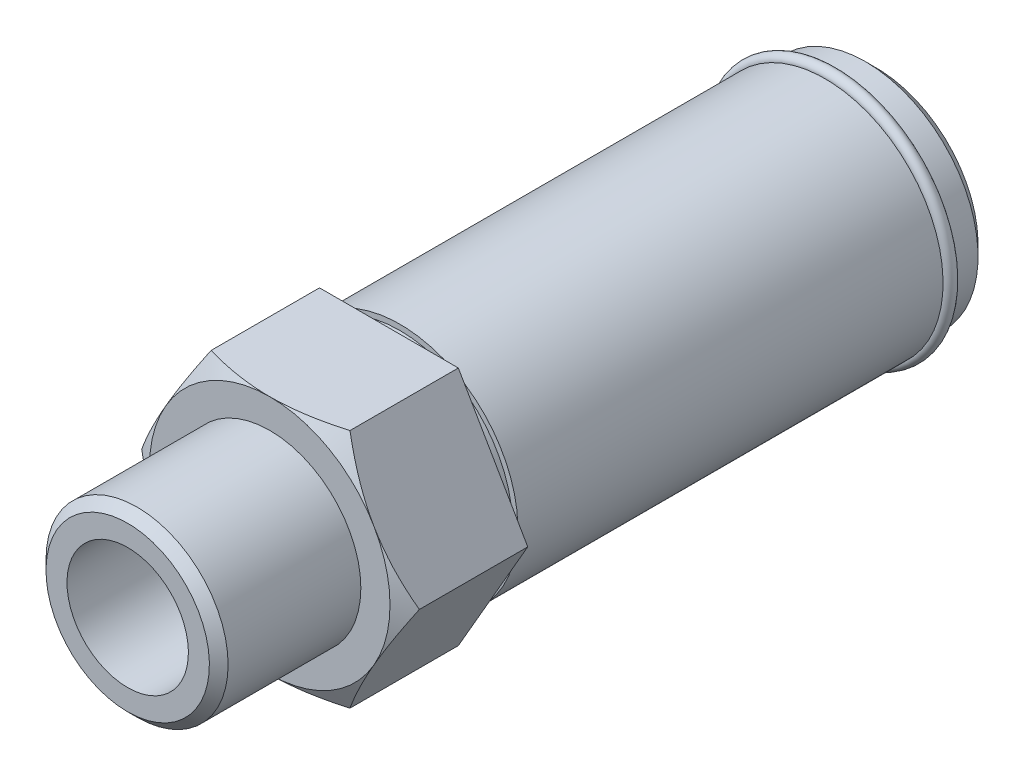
from build123d import *

# Parameters (mm, degrees)
CUT_EXTRUDE_START   = -10.9
SKETCH_2_R          = 22
CUT_EXTRUDE_1_DEPTH = 10.9


with BuildPart() as part:
    # Sketch 1 → Revolve 1 (revolve)
    with BuildSketch(Plane(origin=(0, 0, 0), x_dir=(0, 0, -1), z_dir=(1, 0, 0)), mode=Mode.PRIVATE) as revolve_1_sk:
        with BuildLine():
            Line((-44.9, 0), (-44.9, 5.554))
            Line((-44.9, 5.554), (-64.9, 5.554))
            Line((-64.9, 5.554), (-64.9, 7.475))
            Line((-64.9, 7.475), (-64.044, 8.331))
            Line((-64.044, 8.331), (-51.9, 8.331))
            Line((-51.9, 8.331), (-51.9, 11))
            Line((-51.9, 11), (-45.549147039, 22))
            Line((-45.549147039, 22), (-41, 22))
            Line((-41, 22), (-41, 10.3))
            Line((-41, 10.3), (-40, 10.3))
            Line((-40, 10.3), (-40, 10.8))
            Line((-40, 10.8), (-1.099636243, 10.8))
            ThreePointArc((-1.099636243, 10.8), (-0.560001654, 11.369909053), (0, 10.82))
            Line((0, 10.82), (0, 10.3))
            Line((0, 10.3), (2.6, 10.3))
            Line((2.6, 10.3), (3.6, 9.3))
            Line((3.6, 9.3), (3.6, 8.331))
            Line((3.6, 8.331), (2.744, 7.475))
            Line((2.744, 7.475), (-9.3, 7.475))
            Line((-9.3, 7.475), (-9.3, 0))
            Line((-9.3, 0), (-44.9, 0))
        make_face()
    revolve(revolve_1_sk.sketch.rotate(Axis((0, 0, -3.6), (0, 0, 1)), 180), axis=Axis((0, 0, -3.6), (0, 0, 1)))

    # Sketch 2 → Cut-Extrude 1 (cut)
    with BuildSketch(Plane.XY.offset(51.9).offset(CUT_EXTRUDE_START)):
        Circle(SKETCH_2_R)
        Polygon((6.350852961, -11), (12.701705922, 0), (6.350852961, 11), (-6.350852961, 11), (-12.701705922, 0), (-6.350852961, -11), align=None, mode=Mode.SUBTRACT)
    extrude(amount=CUT_EXTRUDE_1_DEPTH, mode=Mode.SUBTRACT)


solid = part.part
